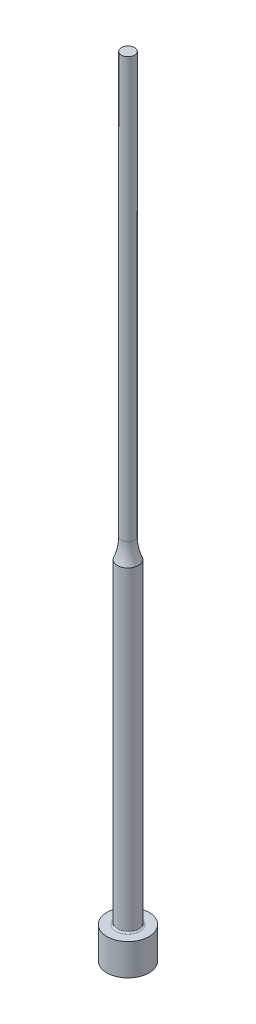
ISO-10303-21;
HEADER;
FILE_DESCRIPTION(('STEP AP214'),'2;1');
FILE_NAME('part.step','',(''),(''),'','','');
FILE_SCHEMA(('AUTOMOTIVE_DESIGN { 1 0 10303 214 1 1 1 1 }'));
ENDSEC;
DATA;
#1=APPLICATION_CONTEXT('core data for automotive mechanical design processes');
#2=APPLICATION_PROTOCOL_DEFINITION('international standard','automotive_design',2000,#1);
#3=PRODUCT_CONTEXT('',#1,'mechanical');
#4=PRODUCT('Part','Part','',(#3));
#5=PRODUCT_RELATED_PRODUCT_CATEGORY('part','',(#4));
#6=PRODUCT_DEFINITION_FORMATION('','',#4);
#7=PRODUCT_DEFINITION_CONTEXT('part definition',#1,'design');
#8=PRODUCT_DEFINITION('design','',#6,#7);
#9=PRODUCT_DEFINITION_SHAPE('','',#8);
#10=(LENGTH_UNIT() NAMED_UNIT(*) SI_UNIT(.MILLI.,.METRE.));
#11=(NAMED_UNIT(*) PLANE_ANGLE_UNIT() SI_UNIT($,.RADIAN.));
#12=(NAMED_UNIT(*) SI_UNIT($,.STERADIAN.) SOLID_ANGLE_UNIT());
#13=UNCERTAINTY_MEASURE_WITH_UNIT(LENGTH_MEASURE(1.E-05),#10,'distance_accuracy_value','');
#14=(GEOMETRIC_REPRESENTATION_CONTEXT(3) GLOBAL_UNCERTAINTY_ASSIGNED_CONTEXT((#13)) GLOBAL_UNIT_ASSIGNED_CONTEXT((#10,
#11,#12)) REPRESENTATION_CONTEXT('',''));
#15=CARTESIAN_POINT('',(0.,0.,0.));
#16=DIRECTION('',(0.,0.,1.));
#17=DIRECTION('',(1.,0.,0.));
#18=AXIS2_PLACEMENT_3D('',#15,#16,#17);
#19=CARTESIAN_POINT('',(1.25000000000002,150.,0.));
#20=DIRECTION('',(0.,-1.,0.));
#21=DIRECTION('',(1.,0.,0.));
#22=AXIS2_PLACEMENT_3D('',#19,#20,#21);
#23=PLANE('',#22);
#24=CARTESIAN_POINT('',(0.,150.,0.));
#25=DIRECTION('',(0.,1.,0.));
#26=DIRECTION('',(-1.,0.,0.));
#27=AXIS2_PLACEMENT_3D('',#24,#25,#26);
#28=CIRCLE('',#27,1.25000000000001);
#29=CARTESIAN_POINT('',(-1.25000000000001,150.,0.));
#30=VERTEX_POINT('',#29);
#31=EDGE_CURVE('E10',#30,#30,#28,.T.);
#32=ORIENTED_EDGE('',*,*,#31,.T.);
#33=EDGE_LOOP('',(#32));
#34=FACE_BOUND('',#33,.T.);
#35=ADVANCED_FACE('F30',(#34),#23,.F.);
#36=CARTESIAN_POINT('',(0.,150.,0.));
#37=DIRECTION('',(0.,1.,0.));
#38=DIRECTION('',(-1.,0.,0.));
#39=AXIS2_PLACEMENT_3D('',#36,#37,#38);
#40=CYLINDRICAL_SURFACE('',#39,1.25000000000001);
#41=ORIENTED_EDGE('',*,*,#31,.F.);
#42=EDGE_LOOP('',(#41));
#43=FACE_BOUND('',#42,.T.);
#44=CARTESIAN_POINT('',(0.,70.,0.));
#45=DIRECTION('',(0.,1.,0.));
#46=DIRECTION('',(-1.,0.,0.));
#47=AXIS2_PLACEMENT_3D('',#44,#45,#46);
#48=CIRCLE('',#47,1.25000000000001);
#49=CARTESIAN_POINT('',(-1.25000000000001,70.,0.));
#50=VERTEX_POINT('',#49);
#51=EDGE_CURVE('E36',#50,#50,#48,.T.);
#52=ORIENTED_EDGE('',*,*,#51,.T.);
#53=EDGE_LOOP('',(#52));
#54=FACE_BOUND('',#53,.T.);
#55=ADVANCED_FACE('F71',(#43,#54),#40,.T.);
#56=CARTESIAN_POINT('',(0.,70.,0.));
#57=DIRECTION('',(0.,1.,0.));
#58=DIRECTION('',(-1.,0.,0.));
#59=AXIS2_PLACEMENT_3D('',#56,#57,#58);
#60=TOROIDAL_SURFACE('',#59,11.25,10.);
#61=ORIENTED_EDGE('',*,*,#51,.F.);
#62=EDGE_LOOP('',(#61));
#63=FACE_BOUND('',#62,.T.);
#64=CARTESIAN_POINT('',(0.,66.2003289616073,0.));
#65=DIRECTION('',(0.,1.,0.));
#66=DIRECTION('',(-1.,0.,0.));
#67=AXIS2_PLACEMENT_3D('',#64,#65,#66);
#68=CIRCLE('',#67,2.00000000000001);
#69=CARTESIAN_POINT('',(-2.00000000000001,66.2003289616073,0.));
#70=VERTEX_POINT('',#69);
#71=EDGE_CURVE('E40',#70,#70,#68,.T.);
#72=ORIENTED_EDGE('',*,*,#71,.T.);
#73=EDGE_LOOP('',(#72));
#74=FACE_BOUND('',#73,.T.);
#75=ADVANCED_FACE('F75',(#63,#74),#60,.F.);
#76=CARTESIAN_POINT('',(0.,150.,0.));
#77=DIRECTION('',(0.,1.,0.));
#78=DIRECTION('',(-1.,0.,0.));
#79=AXIS2_PLACEMENT_3D('',#76,#77,#78);
#80=CYLINDRICAL_SURFACE('',#79,2.00000000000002);
#81=ORIENTED_EDGE('',*,*,#71,.F.);
#82=EDGE_LOOP('',(#81));
#83=FACE_BOUND('',#82,.T.);
#84=CARTESIAN_POINT('',(0.,6.3,0.));
#85=DIRECTION('',(0.,1.,0.));
#86=DIRECTION('',(-1.,0.,0.));
#87=AXIS2_PLACEMENT_3D('',#84,#85,#86);
#88=CIRCLE('',#87,2.00000000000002);
#89=CARTESIAN_POINT('',(-2.00000000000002,6.3,0.));
#90=VERTEX_POINT('',#89);
#91=EDGE_CURVE('E44',#90,#90,#88,.T.);
#92=ORIENTED_EDGE('',*,*,#91,.T.);
#93=EDGE_LOOP('',(#92));
#94=FACE_BOUND('',#93,.T.);
#95=ADVANCED_FACE('F80',(#83,#94),#80,.T.);
#96=CARTESIAN_POINT('',(0.,6.3,0.));
#97=DIRECTION('',(0.,1.,0.));
#98=DIRECTION('',(-1.,0.,0.));
#99=AXIS2_PLACEMENT_3D('',#96,#97,#98);
#100=TOROIDAL_SURFACE('',#99,2.30000000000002,0.3);
#101=ORIENTED_EDGE('',*,*,#91,.F.);
#102=EDGE_LOOP('',(#101));
#103=FACE_BOUND('',#102,.T.);
#104=CARTESIAN_POINT('',(0.,6.00000000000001,0.));
#105=DIRECTION('',(0.,1.,0.));
#106=DIRECTION('',(-1.,0.,0.));
#107=AXIS2_PLACEMENT_3D('',#104,#105,#106);
#108=CIRCLE('',#107,2.30000000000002);
#109=CARTESIAN_POINT('',(-2.30000000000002,6.00000000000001,0.));
#110=VERTEX_POINT('',#109);
#111=EDGE_CURVE('E49',#110,#110,#108,.T.);
#112=ORIENTED_EDGE('',*,*,#111,.T.);
#113=EDGE_LOOP('',(#112));
#114=FACE_BOUND('',#113,.T.);
#115=ADVANCED_FACE('F86',(#103,#114),#100,.F.);
#116=CARTESIAN_POINT('',(4.00000000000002,6.,0.));
#117=DIRECTION('',(0.,-1.,0.));
#118=DIRECTION('',(1.,0.,0.));
#119=AXIS2_PLACEMENT_3D('',#116,#117,#118);
#120=PLANE('',#119);
#121=ORIENTED_EDGE('',*,*,#111,.F.);
#122=EDGE_LOOP('',(#121));
#123=FACE_BOUND('',#122,.T.);
#124=CARTESIAN_POINT('',(0.,6.00000000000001,0.));
#125=DIRECTION('',(0.,1.,0.));
#126=DIRECTION('',(-1.,0.,0.));
#127=AXIS2_PLACEMENT_3D('',#124,#125,#126);
#128=CIRCLE('',#127,4.00000000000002);
#129=CARTESIAN_POINT('',(-4.00000000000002,6.00000000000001,0.));
#130=VERTEX_POINT('',#129);
#131=EDGE_CURVE('E52',#130,#130,#128,.T.);
#132=ORIENTED_EDGE('',*,*,#131,.T.);
#133=EDGE_LOOP('',(#132));
#134=FACE_BOUND('',#133,.T.);
#135=ADVANCED_FACE('F67',(#123,#134),#120,.F.);
#136=CARTESIAN_POINT('',(0.,150.,0.));
#137=DIRECTION('',(0.,1.,0.));
#138=DIRECTION('',(-1.,0.,0.));
#139=AXIS2_PLACEMENT_3D('',#136,#137,#138);
#140=CYLINDRICAL_SURFACE('',#139,4.00000000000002);
#141=ORIENTED_EDGE('',*,*,#131,.F.);
#142=EDGE_LOOP('',(#141));
#143=FACE_BOUND('',#142,.T.);
#144=CARTESIAN_POINT('',(0.,0.,0.));
#145=DIRECTION('',(0.,1.,0.));
#146=DIRECTION('',(-1.,0.,0.));
#147=AXIS2_PLACEMENT_3D('',#144,#145,#146);
#148=CIRCLE('',#147,4.00000000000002);
#149=CARTESIAN_POINT('',(-4.00000000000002,0.,0.));
#150=VERTEX_POINT('',#149);
#151=EDGE_CURVE('E55',#150,#150,#148,.T.);
#152=ORIENTED_EDGE('',*,*,#151,.T.);
#153=EDGE_LOOP('',(#152));
#154=FACE_BOUND('',#153,.T.);
#155=ADVANCED_FACE('F59',(#143,#154),#140,.T.);
#156=CARTESIAN_POINT('',(0.,0.,0.));
#157=DIRECTION('',(0.,1.,0.));
#158=DIRECTION('',(-1.,0.,0.));
#159=AXIS2_PLACEMENT_3D('',#156,#157,#158);
#160=PLANE('',#159);
#161=ORIENTED_EDGE('',*,*,#151,.F.);
#162=EDGE_LOOP('',(#161));
#163=FACE_BOUND('',#162,.T.);
#164=ADVANCED_FACE('F61',(#163),#160,.F.);
#165=CLOSED_SHELL('',(#35,#55,#75,#95,#115,#135,#155,#164));
#166=MANIFOLD_SOLID_BREP('B2',#165);
#167=ADVANCED_BREP_SHAPE_REPRESENTATION('',(#18,#166),#14);
#168=SHAPE_DEFINITION_REPRESENTATION(#9,#167);
ENDSEC;
END-ISO-10303-21;
